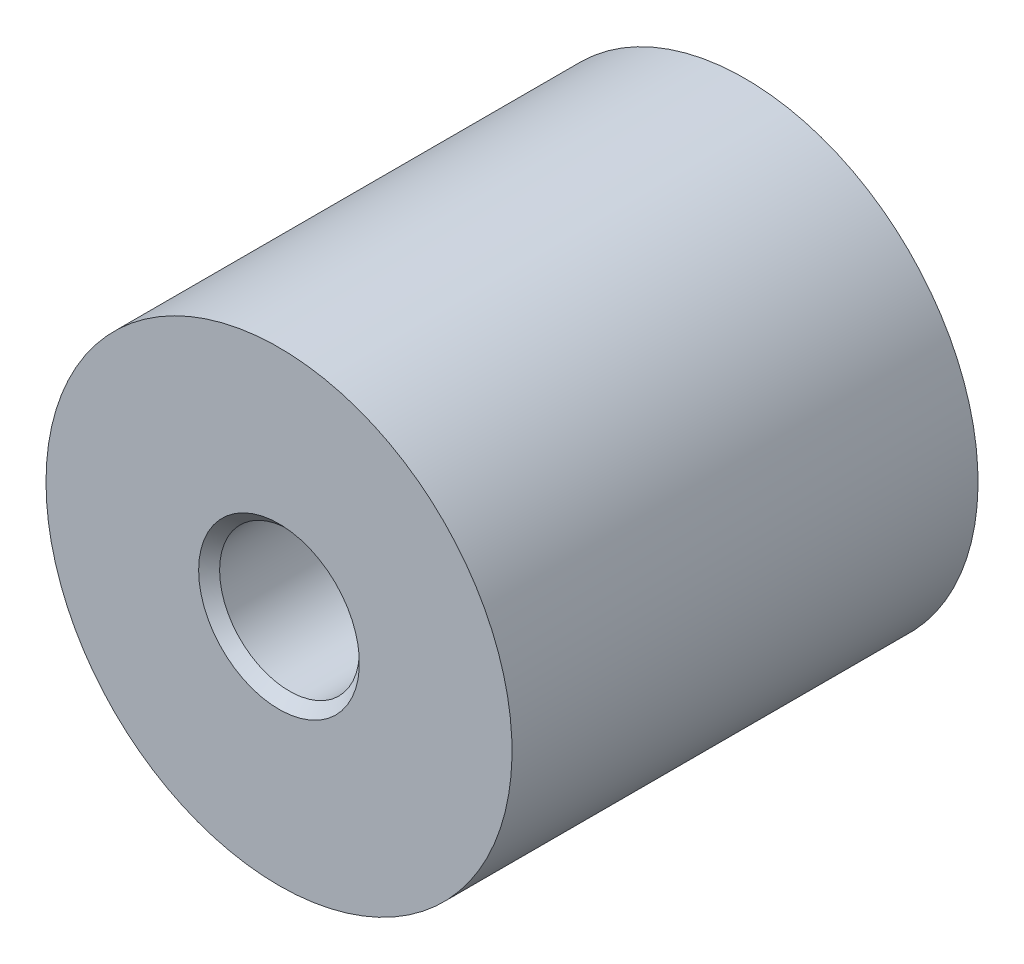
ISO-10303-21;
HEADER;
FILE_DESCRIPTION(('STEP AP214'),'2;1');
FILE_NAME('part.step','',(''),(''),'','','');
FILE_SCHEMA(('AUTOMOTIVE_DESIGN { 1 0 10303 214 1 1 1 1 }'));
ENDSEC;
DATA;
#1=APPLICATION_CONTEXT('core data for automotive mechanical design processes');
#2=APPLICATION_PROTOCOL_DEFINITION('international standard','automotive_design',2000,#1);
#3=PRODUCT_CONTEXT('',#1,'mechanical');
#4=PRODUCT('Part','Part','',(#3));
#5=PRODUCT_RELATED_PRODUCT_CATEGORY('part','',(#4));
#6=PRODUCT_DEFINITION_FORMATION('','',#4);
#7=PRODUCT_DEFINITION_CONTEXT('part definition',#1,'design');
#8=PRODUCT_DEFINITION('design','',#6,#7);
#9=PRODUCT_DEFINITION_SHAPE('','',#8);
#10=(LENGTH_UNIT() NAMED_UNIT(*) SI_UNIT(.MILLI.,.METRE.));
#11=(NAMED_UNIT(*) PLANE_ANGLE_UNIT() SI_UNIT($,.RADIAN.));
#12=(NAMED_UNIT(*) SI_UNIT($,.STERADIAN.) SOLID_ANGLE_UNIT());
#13=UNCERTAINTY_MEASURE_WITH_UNIT(LENGTH_MEASURE(1.E-05),#10,'distance_accuracy_value','');
#14=(GEOMETRIC_REPRESENTATION_CONTEXT(3) GLOBAL_UNCERTAINTY_ASSIGNED_CONTEXT((#13)) GLOBAL_UNIT_ASSIGNED_CONTEXT((#10,
#11,#12)) REPRESENTATION_CONTEXT('',''));
#15=CARTESIAN_POINT('',(0.,0.,0.));
#16=DIRECTION('',(0.,0.,1.));
#17=DIRECTION('',(1.,0.,0.));
#18=AXIS2_PLACEMENT_3D('',#15,#16,#17);
#19=CARTESIAN_POINT('',(0.,0.,0.5));
#20=DIRECTION('',(0.,0.,1.));
#21=DIRECTION('',(0.,-1.,0.));
#22=AXIS2_PLACEMENT_3D('',#19,#20,#21);
#23=CYLINDRICAL_SURFACE('',#22,10.);
#24=CARTESIAN_POINT('',(0.,0.,0.));
#25=DIRECTION('',(0.,0.,1.));
#26=DIRECTION('',(0.,-1.,0.));
#27=AXIS2_PLACEMENT_3D('',#24,#25,#26);
#28=CIRCLE('',#27,10.);
#29=CARTESIAN_POINT('',(0.,-10.,0.));
#30=VERTEX_POINT('',#29);
#31=EDGE_CURVE('E23',#30,#30,#28,.T.);
#32=ORIENTED_EDGE('',*,*,#31,.T.);
#33=EDGE_LOOP('',(#32));
#34=FACE_BOUND('',#33,.T.);
#35=CARTESIAN_POINT('',(0.,0.,20.));
#36=DIRECTION('',(0.,0.,-1.));
#37=DIRECTION('',(-1.,0.,0.));
#38=AXIS2_PLACEMENT_3D('',#35,#36,#37);
#39=CIRCLE('',#38,10.);
#40=CARTESIAN_POINT('',(-10.,0.,20.));
#41=VERTEX_POINT('',#40);
#42=EDGE_CURVE('E32',#41,#41,#39,.T.);
#43=ORIENTED_EDGE('',*,*,#42,.T.);
#44=EDGE_LOOP('',(#43));
#45=FACE_BOUND('',#44,.T.);
#46=ADVANCED_FACE('F12',(#34,#45),#23,.T.);
#47=CARTESIAN_POINT('',(10.,0.,0.));
#48=DIRECTION('',(0.,0.,-1.));
#49=DIRECTION('',(0.,1.,0.));
#50=AXIS2_PLACEMENT_3D('',#47,#48,#49);
#51=PLANE('',#50);
#52=CARTESIAN_POINT('',(0.,0.,0.));
#53=DIRECTION('',(0.,0.,-1.));
#54=DIRECTION('',(0.,1.,0.));
#55=AXIS2_PLACEMENT_3D('',#52,#53,#54);
#56=CIRCLE('',#55,3.45);
#57=CARTESIAN_POINT('',(0.,3.45,0.));
#58=VERTEX_POINT('',#57);
#59=EDGE_CURVE('E8',#58,#58,#56,.F.);
#60=ORIENTED_EDGE('',*,*,#59,.T.);
#61=EDGE_LOOP('',(#60));
#62=FACE_BOUND('',#61,.T.);
#63=ORIENTED_EDGE('',*,*,#31,.F.);
#64=EDGE_LOOP('',(#63));
#65=FACE_BOUND('',#64,.T.);
#66=ADVANCED_FACE('F59',(#62,#65),#51,.T.);
#67=CARTESIAN_POINT('',(0.,0.,0.));
#68=DIRECTION('',(0.,0.,1.));
#69=DIRECTION('',(0.,-1.,0.));
#70=AXIS2_PLACEMENT_3D('',#67,#68,#69);
#71=CYLINDRICAL_SURFACE('',#70,3.);
#72=CARTESIAN_POINT('',(0.,0.,0.45));
#73=DIRECTION('',(0.,0.,-1.));
#74=DIRECTION('',(0.,1.,0.));
#75=AXIS2_PLACEMENT_3D('',#72,#73,#74);
#76=CIRCLE('',#75,3.);
#77=CARTESIAN_POINT('',(0.,3.,0.45));
#78=VERTEX_POINT('',#77);
#79=EDGE_CURVE('E19',#78,#78,#76,.T.);
#80=ORIENTED_EDGE('',*,*,#79,.T.);
#81=EDGE_LOOP('',(#80));
#82=FACE_BOUND('',#81,.T.);
#83=CARTESIAN_POINT('',(0.,0.,6.));
#84=DIRECTION('',(0.,0.,-1.));
#85=DIRECTION('',(0.,1.,0.));
#86=AXIS2_PLACEMENT_3D('',#83,#84,#85);
#87=CIRCLE('',#86,3.);
#88=CARTESIAN_POINT('',(0.,3.,6.));
#89=VERTEX_POINT('',#88);
#90=EDGE_CURVE('E27',#89,#89,#87,.T.);
#91=ORIENTED_EDGE('',*,*,#90,.F.);
#92=EDGE_LOOP('',(#91));
#93=FACE_BOUND('',#92,.T.);
#94=ADVANCED_FACE('F64',(#82,#93),#71,.F.);
#95=CARTESIAN_POINT('',(0.,0.,6.));
#96=DIRECTION('',(0.,0.,-1.));
#97=DIRECTION('',(0.,1.,0.));
#98=AXIS2_PLACEMENT_3D('',#95,#96,#97);
#99=PLANE('',#98);
#100=ORIENTED_EDGE('',*,*,#90,.T.);
#101=EDGE_LOOP('',(#100));
#102=FACE_BOUND('',#101,.T.);
#103=ADVANCED_FACE('F69',(#102),#99,.T.);
#104=CARTESIAN_POINT('',(0.,0.,0.45));
#105=DIRECTION('',(0.,0.,-1.));
#106=DIRECTION('',(0.,1.,0.));
#107=AXIS2_PLACEMENT_3D('',#104,#105,#106);
#108=CONICAL_SURFACE('',#107,3.,0.785398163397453);
#109=ORIENTED_EDGE('',*,*,#59,.F.);
#110=EDGE_LOOP('',(#109));
#111=FACE_BOUND('',#110,.T.);
#112=ORIENTED_EDGE('',*,*,#79,.F.);
#113=EDGE_LOOP('',(#112));
#114=FACE_BOUND('',#113,.T.);
#115=ADVANCED_FACE('F14',(#111,#114),#108,.F.);
#116=CARTESIAN_POINT('',(0.,0.,20.));
#117=DIRECTION('',(0.,0.,1.));
#118=DIRECTION('',(1.,0.,0.));
#119=AXIS2_PLACEMENT_3D('',#116,#117,#118);
#120=CONICAL_SURFACE('',#119,3.45,0.785398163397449);
#121=CARTESIAN_POINT('',(0.,0.,19.55));
#122=DIRECTION('',(0.,0.,-1.));
#123=DIRECTION('',(-1.,0.,0.));
#124=AXIS2_PLACEMENT_3D('',#121,#122,#123);
#125=CIRCLE('',#124,3.);
#126=CARTESIAN_POINT('',(-3.,0.,19.55));
#127=VERTEX_POINT('',#126);
#128=EDGE_CURVE('E38',#127,#127,#125,.T.);
#129=ORIENTED_EDGE('',*,*,#128,.T.);
#130=EDGE_LOOP('',(#129));
#131=FACE_BOUND('',#130,.T.);
#132=CARTESIAN_POINT('',(0.,0.,20.));
#133=DIRECTION('',(0.,0.,-1.));
#134=DIRECTION('',(-1.,0.,0.));
#135=AXIS2_PLACEMENT_3D('',#132,#133,#134);
#136=CIRCLE('',#135,3.45);
#137=CARTESIAN_POINT('',(-3.45,0.,20.));
#138=VERTEX_POINT('',#137);
#139=EDGE_CURVE('E35',#138,#138,#136,.T.);
#140=ORIENTED_EDGE('',*,*,#139,.F.);
#141=EDGE_LOOP('',(#140));
#142=FACE_BOUND('',#141,.T.);
#143=ADVANCED_FACE('F75',(#131,#142),#120,.F.);
#144=CARTESIAN_POINT('',(0.,10.,20.));
#145=DIRECTION('',(0.,0.,1.));
#146=DIRECTION('',(1.,0.,0.));
#147=AXIS2_PLACEMENT_3D('',#144,#145,#146);
#148=PLANE('',#147);
#149=ORIENTED_EDGE('',*,*,#139,.T.);
#150=EDGE_LOOP('',(#149));
#151=FACE_BOUND('',#150,.T.);
#152=ORIENTED_EDGE('',*,*,#42,.F.);
#153=EDGE_LOOP('',(#152));
#154=FACE_BOUND('',#153,.T.);
#155=ADVANCED_FACE('F55',(#151,#154),#148,.T.);
#156=CARTESIAN_POINT('',(0.,0.,11.));
#157=DIRECTION('',(0.,0.,1.));
#158=DIRECTION('',(0.,-1.,0.));
#159=AXIS2_PLACEMENT_3D('',#156,#157,#158);
#160=CYLINDRICAL_SURFACE('',#159,3.);
#161=CARTESIAN_POINT('',(0.,0.,14.));
#162=DIRECTION('',(0.,0.,-1.));
#163=DIRECTION('',(-1.,0.,0.));
#164=AXIS2_PLACEMENT_3D('',#161,#162,#163);
#165=CIRCLE('',#164,3.);
#166=CARTESIAN_POINT('',(-3.,0.,14.));
#167=VERTEX_POINT('',#166);
#168=EDGE_CURVE('E41',#167,#167,#165,.T.);
#169=ORIENTED_EDGE('',*,*,#168,.T.);
#170=EDGE_LOOP('',(#169));
#171=FACE_BOUND('',#170,.T.);
#172=ORIENTED_EDGE('',*,*,#128,.F.);
#173=EDGE_LOOP('',(#172));
#174=FACE_BOUND('',#173,.T.);
#175=ADVANCED_FACE('F45',(#171,#174),#160,.F.);
#176=CARTESIAN_POINT('',(0.,3.,14.));
#177=DIRECTION('',(0.,0.,1.));
#178=DIRECTION('',(1.,0.,0.));
#179=AXIS2_PLACEMENT_3D('',#176,#177,#178);
#180=PLANE('',#179);
#181=ORIENTED_EDGE('',*,*,#168,.F.);
#182=EDGE_LOOP('',(#181));
#183=FACE_BOUND('',#182,.T.);
#184=ADVANCED_FACE('F48',(#183),#180,.T.);
#185=CLOSED_SHELL('',(#46,#66,#94,#103,#115,#143,#155,#175,#184));
#186=MANIFOLD_SOLID_BREP('B1',#185);
#187=ADVANCED_BREP_SHAPE_REPRESENTATION('',(#18,#186),#14);
#188=SHAPE_DEFINITION_REPRESENTATION(#9,#187);
ENDSEC;
END-ISO-10303-21;
